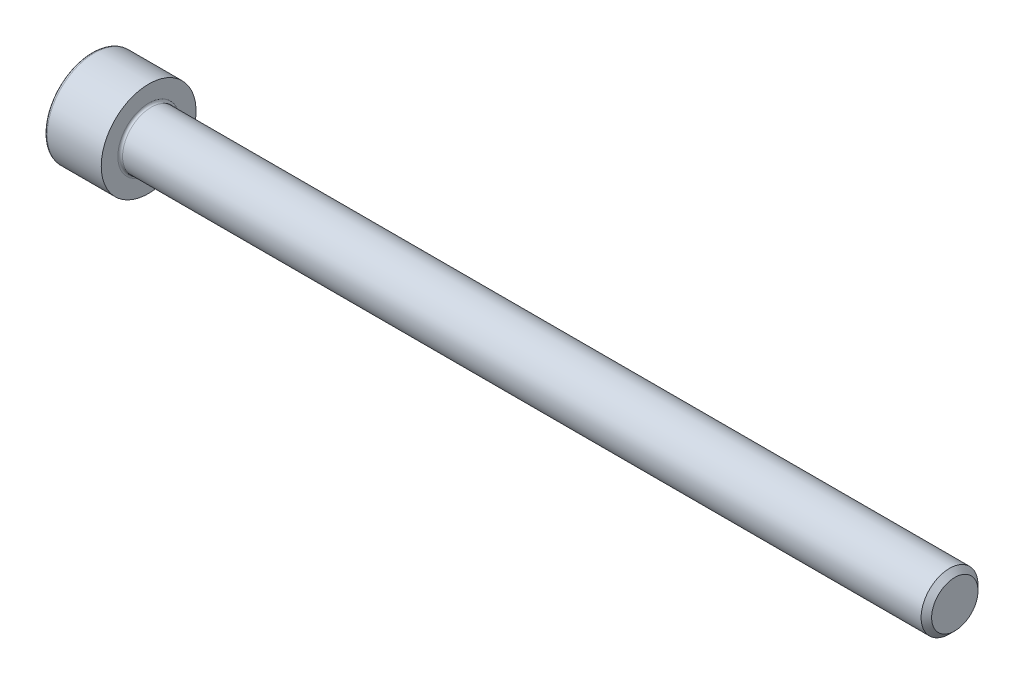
from build123d import *

# Parameters (mm, degrees)
FILLET1_R   = 0.25
FILLET2_R   = 0.3
HEX_2_DEPTH = 3


with BuildPart() as part:
    # BodySke → Base-Revolve (revolve)
    with BuildSketch(Plane.XY, mode=Mode.PRIVATE) as base_revolve_sk:
        Polygon((0, 0), (0, 5), (6, 5), (6, 3), (90.4455, 3), (91, 2.4455), (91, 0), align=None)
    revolve(base_revolve_sk.sketch.rotate(Axis((-31.75, 0, 0), (1, 0, 0)), 90), axis=Axis((-31.75, 0, 0), (1, 0, 0)))

    # Fillet1
    fillet1_edges = [part.edges().sort_by_distance(p)[0] for p in [
        (6, 0, -3),
    ]]
    fillet(fillet1_edges, radius=FILLET1_R)

    # Fillet2
    fillet2_edges = [part.edges().sort_by_distance(p)[0] for p in [
        (0, 0, -5),
    ]]
    fillet(fillet2_edges, radius=FILLET2_R)

    # Sketch2 → Hex-PreBroach (revolve, cut)
    with BuildSketch(Plane.XY, mode=Mode.PRIVATE) as hex_prebroach_sk:
        Polygon((0, 2.542), (3, 2.542), (4.467624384, 0), (0, 0), align=None)
    revolve(hex_prebroach_sk.sketch.rotate(Axis((0, 0, 0), (1, 0, 0)), 90), axis=Axis((0, 0, 0), (1, 0, 0)), mode=Mode.SUBTRACT)

    # Sketch3 → Hex 2 (cut)
    with BuildSketch(Plane(origin=(0, 0, 0), x_dir=(0, 0.500000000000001, 0.866025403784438), z_dir=(-1, 0, 0))):
        Polygon((1.467624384, 2.542), (-1.467624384, 2.542), (-2.935248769, 0), (-1.467624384, -2.542), (1.467624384, -2.542), (2.935248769, 0), align=None)
    extrude(amount=-HEX_2_DEPTH, mode=Mode.SUBTRACT)


solid = part.part
